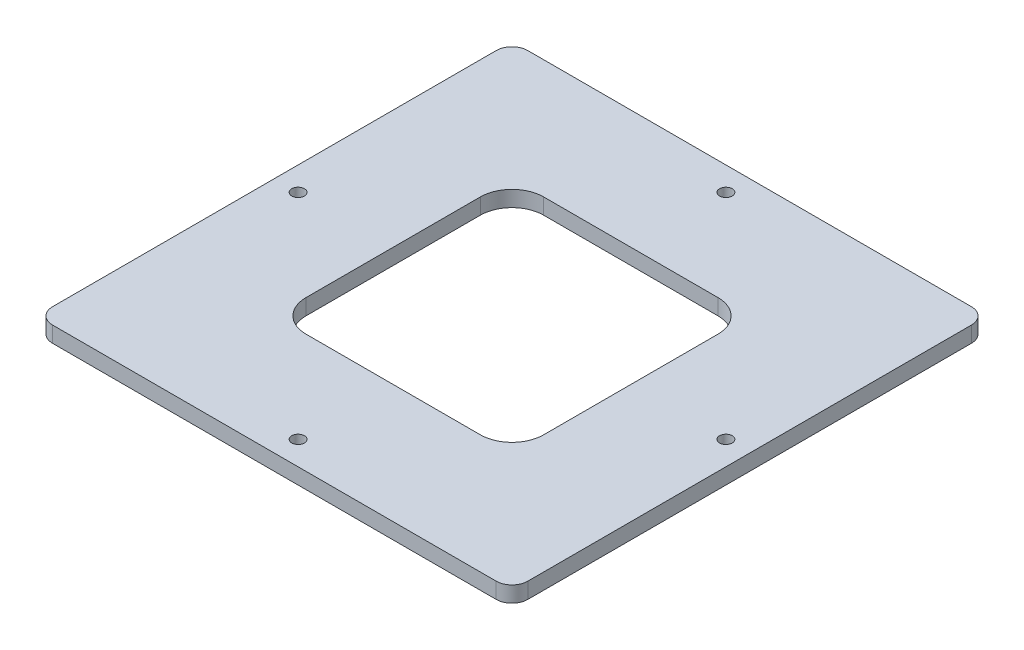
from build123d import *

# Parameters (mm, degrees)
SKIZZE1_R                       = 1.6
AUFSATZ_LINEAR_AUSTRAGEN1_DEPTH = 4


with BuildPart() as part:
    # Skizze1 → Aufsatz-Linear austragen1 (new body)
    with BuildSketch(Plane(origin=(0, 0, 0), x_dir=(1, 0, 0), z_dir=(0, 1, 0))):
        with BuildLine():
            Line((-56, 60), (56, 60))
            ThreePointArc((56, 60), (58.828427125, 58.828427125), (60, 56))
            Line((60, 56), (60, -56))
            ThreePointArc((60, -56), (58.828427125, -58.828427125), (56, -60))
            Line((56, -60), (-56, -60))
            ThreePointArc((-56, -60), (-58.828427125, -58.828427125), (-60, -56))
            Line((-60, -56), (-60, 56))
            ThreePointArc((-60, 56), (-58.828427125, 58.828427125), (-56, 60))
        make_face()
        with Locations(Location((0, 54, 0), (0, 0, 270))):
            Circle(SKIZZE1_R, mode=Mode.SUBTRACT)
        with Locations(Location((54, 0, 0), (0, 0, 270))):
            Circle(SKIZZE1_R, mode=Mode.SUBTRACT)
        with Locations(Location((0, -54, 0), (0, 0, 270))):
            Circle(SKIZZE1_R, mode=Mode.SUBTRACT)
        with Locations(Location((-54, 0, 0), (0, 0, 270))):
            Circle(SKIZZE1_R, mode=Mode.SUBTRACT)
        with BuildLine():
            Line((-22, 30), (22, 30))
            ThreePointArc((22, 30), (27.656854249, 27.656854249), (30, 22))
            Line((30, 22), (30, -22))
            ThreePointArc((30, -22), (27.656854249, -27.656854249), (22, -30))
            Line((22, -30), (-22, -30))
            ThreePointArc((-22, -30), (-27.656854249, -27.656854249), (-30, -22))
            Line((-30, -22), (-30, 22))
            ThreePointArc((-30, 22), (-27.656854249, 27.656854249), (-22, 30))
        make_face(mode=Mode.SUBTRACT)
    extrude(amount=AUFSATZ_LINEAR_AUSTRAGEN1_DEPTH)


solid = part.part
